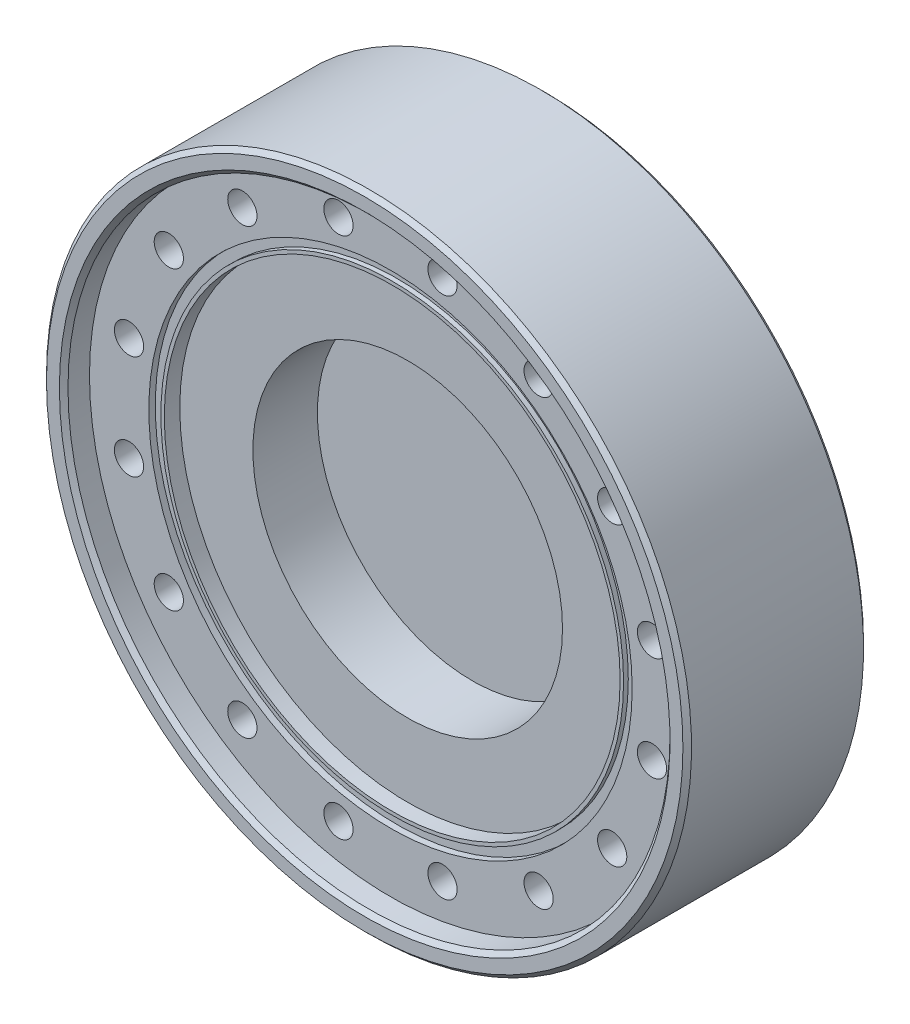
from build123d import *

# Parameters (mm, degrees)
PATTERN_CIRCULAR_1_COUNT  = 6
HOLE_WIZARD_4_0_4_1_D     = 4
HOLE_WIZARD_4_0_4_1_DEPTH = 6
HOLE_WIZARD_4_0_4_1_TIP   = 1.201721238
HOLE_WIZARD_1_D           = 3.4
HOLE_WIZARD_1_CBORE_D     = 6
HOLE_WIZARD_1_CBORE_DEPTH = 4
PATTERN_CIRCULAR_2_COUNT  = 16
CUT_EXTRUDE_START         = -10
CUT_EXTRUDE_1_DEPTH       = 10
SKETCH_10_R               = 28.1
SKETCH_10_R_2             = 26.9
CUT_EXTRUDE_3_DEPTH       = 0.75
SKETCH_11_R               = 9
CUT_EXTRUDE_4_DEPTH       = 6
SKETCH_12_R               = 26.9
CUT_EXTRUDE_5_DEPTH       = 0.2
CHAMFER_1_SIZE            = 0.5


with BuildPart() as part:
    # Sketch 2 → Revolve 1 (revolve)
    with BuildSketch(Plane(origin=(0, 0, 0), x_dir=(0, 0, -1), z_dir=(1, 0, 0)), mode=Mode.PRIVATE) as revolve_1_sk:
        Polygon((3, 26.5), (5, 26.5), (5, 18), (12.5, 18), (12.5, 0), (21, 0), (21, 37.5), (0, 37.5), (0, 35), (3, 35), align=None)
    revolve(revolve_1_sk.sketch.rotate(Axis((0, 0, 0), (0, 0, -1)), 90), axis=Axis((0, 0, 0), (0, 0, -1)))

    # Sketch 3 → Hole Wizard M6 _1 (revolve, cut)
    with BuildSketch(Plane(origin=(0, 22.5, -21), x_dir=(0, 1, 0), z_dir=(1, 0, 0))):
        Polygon((0, 0), (0, 14.502151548), (2.5, 13), (2.5, 0), align=None)
    hole_wizard_m6_1 = revolve(axis=Axis((0, 22.5, -27.35), (0, 0, 1)), mode=Mode.SUBTRACT)

    # Pattern Circular 1: Hole Wizard M6 _1 ×6 about axis
    pattern_circular_1_axis = Axis((0, 0, 0), (0, 0, 1))
    for i in range(1, PATTERN_CIRCULAR_1_COUNT):
        add(hole_wizard_m6_1.rotate(pattern_circular_1_axis, i * 360 / PATTERN_CIRCULAR_1_COUNT), mode=Mode.SUBTRACT)

    # Hole Wizard 4.0 _4_ _1
    with Locations(Plane(origin=(0, 0, -21), x_dir=(-1, 0, 0), z_dir=(0, 0, -1))):
        with Locations((-22.5, 0)):
            Hole(HOLE_WIZARD_4_0_4_1_D / 2, depth=HOLE_WIZARD_4_0_4_1_DEPTH)
            with Locations((0, 0, -(HOLE_WIZARD_4_0_4_1_DEPTH + HOLE_WIZARD_4_0_4_1_TIP / 2))):  # 118° drill point
                Cone(0, HOLE_WIZARD_4_0_4_1_D / 2, HOLE_WIZARD_4_0_4_1_TIP, mode=Mode.SUBTRACT)

    # Hole Wizard 1 (through all)
    with Locations(Plane(origin=(0, 0, -21), x_dir=(-1, 0, 0), z_dir=(0, 0, -1))):
        with Locations((30.404343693, 6.047799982)):
            hole_wizard_1 = CounterBoreHole(HOLE_WIZARD_1_D / 2, HOLE_WIZARD_1_CBORE_D / 2, HOLE_WIZARD_1_CBORE_DEPTH)

    # Pattern Circular 2: Hole Wizard 1 ×16 about axis
    pattern_circular_2_axis = Axis((0, 0, 0), (0, 0, 1))
    for i in range(1, PATTERN_CIRCULAR_2_COUNT):
        add(hole_wizard_1.rotate(pattern_circular_2_axis, i * 360 / PATTERN_CIRCULAR_2_COUNT), mode=Mode.SUBTRACT)

    # Sketch 9 → Cut-Extrude 1 (cut)
    with BuildSketch(Plane(origin=(0, 0, -21), x_dir=(-1, 0, 0), z_dir=(0, 0, -1)).offset(CUT_EXTRUDE_START)):
        with BuildLine():
            Line((34, 3), (37.379807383, 3))
            ThreePointArc((37.379807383, 3), (37.5, 0), (37.379807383, -3))
            Line((37.379807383, -3), (34, -3))
            ThreePointArc((34, -3), (31, 0), (34, 3))
        make_face()
    extrude(amount=CUT_EXTRUDE_1_DEPTH, mode=Mode.SUBTRACT)

    # Sketch 10 → Cut-Extrude 3 (cut)
    with BuildSketch(Plane.XY.offset(-3)):
        Circle(SKETCH_10_R)
        Circle(SKETCH_10_R_2, mode=Mode.SUBTRACT)
    extrude(amount=-CUT_EXTRUDE_3_DEPTH, mode=Mode.SUBTRACT)

    # Sketch 11 → Cut-Extrude 4 (cut)
    with BuildSketch(Plane(origin=(0, 0, -21), x_dir=(-1, 0, 0), z_dir=(0, 0, -1))):
        Circle(SKETCH_11_R)
    extrude(amount=-CUT_EXTRUDE_4_DEPTH, mode=Mode.SUBTRACT)

    # Sketch 12 → Cut-Extrude 5 (cut)
    with BuildSketch(Plane.XY.offset(-3)):
        Circle(SKETCH_12_R)
    extrude(amount=-CUT_EXTRUDE_5_DEPTH, mode=Mode.SUBTRACT)

    # Chamfer 1
    chamfer_1_edges = [part.edges().sort_by_distance(p)[0] for p in [
        (1.501203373, 37.469939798, -21),
        (9, 0, -21),
        (-37.5, 0, 0),
        (-35, 0, 0),
    ]]
    chamfer(chamfer_1_edges, length=CHAMFER_1_SIZE)


solid = part.part
